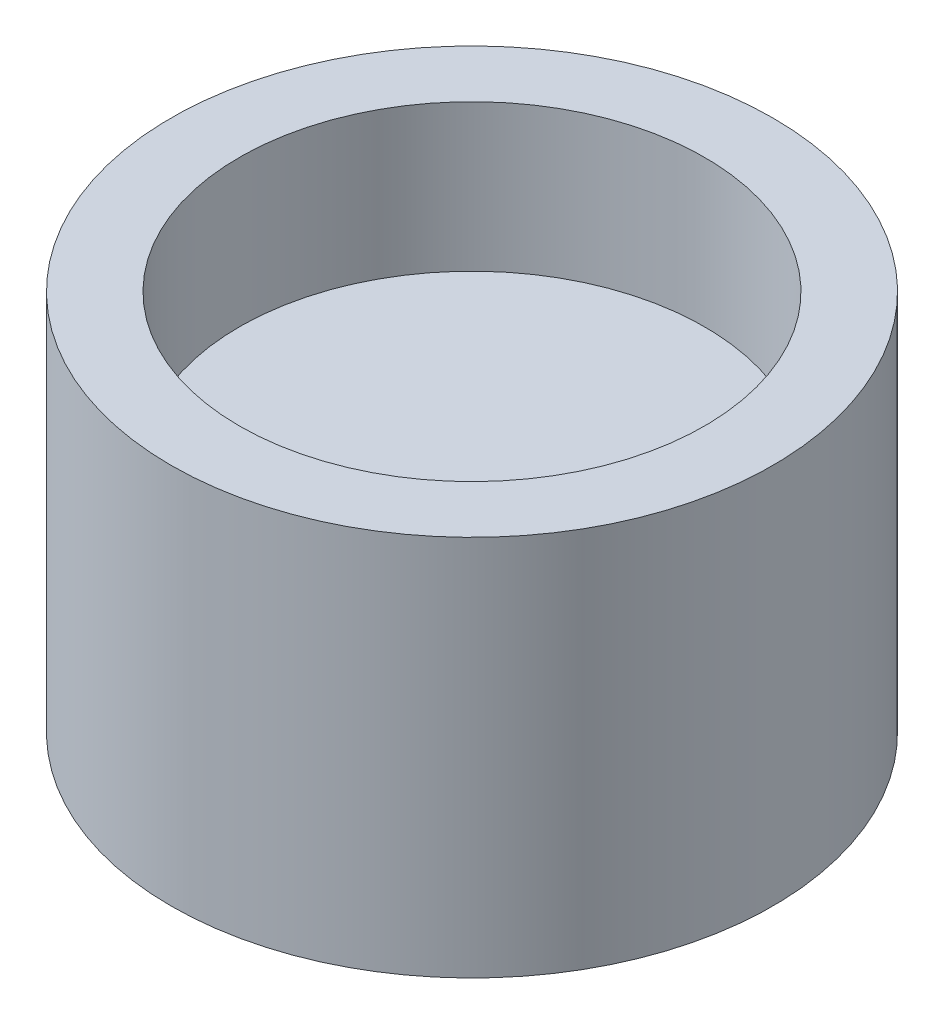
ISO-10303-21;
HEADER;
FILE_DESCRIPTION(('STEP AP214'),'2;1');
FILE_NAME('part.step','',(''),(''),'','','');
FILE_SCHEMA(('AUTOMOTIVE_DESIGN { 1 0 10303 214 1 1 1 1 }'));
ENDSEC;
DATA;
#1=APPLICATION_CONTEXT('core data for automotive mechanical design processes');
#2=APPLICATION_PROTOCOL_DEFINITION('international standard','automotive_design',2000,#1);
#3=PRODUCT_CONTEXT('',#1,'mechanical');
#4=PRODUCT('Part','Part','',(#3));
#5=PRODUCT_RELATED_PRODUCT_CATEGORY('part','',(#4));
#6=PRODUCT_DEFINITION_FORMATION('','',#4);
#7=PRODUCT_DEFINITION_CONTEXT('part definition',#1,'design');
#8=PRODUCT_DEFINITION('design','',#6,#7);
#9=PRODUCT_DEFINITION_SHAPE('','',#8);
#10=(LENGTH_UNIT() NAMED_UNIT(*) SI_UNIT(.MILLI.,.METRE.));
#11=(NAMED_UNIT(*) PLANE_ANGLE_UNIT() SI_UNIT($,.RADIAN.));
#12=(NAMED_UNIT(*) SI_UNIT($,.STERADIAN.) SOLID_ANGLE_UNIT());
#13=UNCERTAINTY_MEASURE_WITH_UNIT(LENGTH_MEASURE(1.E-05),#10,'distance_accuracy_value','');
#14=(GEOMETRIC_REPRESENTATION_CONTEXT(3) GLOBAL_UNCERTAINTY_ASSIGNED_CONTEXT((#13)) GLOBAL_UNIT_ASSIGNED_CONTEXT((#10,
#11,#12)) REPRESENTATION_CONTEXT('',''));
#15=CARTESIAN_POINT('',(0.,0.,0.));
#16=DIRECTION('',(0.,0.,1.));
#17=DIRECTION('',(1.,0.,0.));
#18=AXIS2_PLACEMENT_3D('',#15,#16,#17);
#19=CARTESIAN_POINT('',(0.,6.604,0.));
#20=DIRECTION('',(0.,-1.,0.));
#21=DIRECTION('',(0.,0.,-1.));
#22=AXIS2_PLACEMENT_3D('',#19,#20,#21);
#23=CYLINDRICAL_SURFACE('',#22,5.207);
#24=CARTESIAN_POINT('',(0.,6.604,0.));
#25=DIRECTION('',(0.,1.,0.));
#26=DIRECTION('',(0.,0.,1.));
#27=AXIS2_PLACEMENT_3D('',#24,#25,#26);
#28=CIRCLE('',#27,5.207);
#29=CARTESIAN_POINT('',(0.,6.604,-5.207));
#30=VERTEX_POINT('',#29);
#31=EDGE_CURVE('E10',#30,#30,#28,.T.);
#32=CARTESIAN_POINT('',(0.,0.,0.));
#33=DIRECTION('',(0.,1.,0.));
#34=DIRECTION('',(0.,0.,1.));
#35=AXIS2_PLACEMENT_3D('',#32,#33,#34);
#36=CIRCLE('',#35,5.207);
#37=CARTESIAN_POINT('',(0.,0.,-5.207));
#38=VERTEX_POINT('',#37);
#39=EDGE_CURVE('E33',#38,#38,#36,.T.);
#40=CARTESIAN_POINT('',(0.,6.604,-5.207));
#41=CARTESIAN_POINT('',(0.,6.53520833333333,-5.207));
#42=CARTESIAN_POINT('',(0.,6.46641666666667,-5.207));
#43=CARTESIAN_POINT('',(0.,6.32883333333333,-5.207));
#44=CARTESIAN_POINT('',(0.,6.26004166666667,-5.207));
#45=CARTESIAN_POINT('',(0.,6.12245833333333,-5.207));
#46=CARTESIAN_POINT('',(0.,6.05366666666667,-5.207));
#47=CARTESIAN_POINT('',(0.,5.91608333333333,-5.207));
#48=CARTESIAN_POINT('',(0.,5.84729166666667,-5.207));
#49=CARTESIAN_POINT('',(0.,5.70970833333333,-5.207));
#50=CARTESIAN_POINT('',(0.,5.64091666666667,-5.207));
#51=CARTESIAN_POINT('',(0.,5.50333333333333,-5.207));
#52=CARTESIAN_POINT('',(0.,5.43454166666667,-5.207));
#53=CARTESIAN_POINT('',(0.,5.29695833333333,-5.207));
#54=CARTESIAN_POINT('',(0.,5.22816666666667,-5.207));
#55=CARTESIAN_POINT('',(0.,5.09058333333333,-5.207));
#56=CARTESIAN_POINT('',(0.,5.02179166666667,-5.207));
#57=CARTESIAN_POINT('',(0.,4.88420833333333,-5.207));
#58=CARTESIAN_POINT('',(0.,4.81541666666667,-5.207));
#59=CARTESIAN_POINT('',(0.,4.67783333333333,-5.207));
#60=CARTESIAN_POINT('',(0.,4.60904166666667,-5.207));
#61=CARTESIAN_POINT('',(0.,4.47145833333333,-5.207));
#62=CARTESIAN_POINT('',(0.,4.40266666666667,-5.207));
#63=CARTESIAN_POINT('',(0.,4.26508333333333,-5.207));
#64=CARTESIAN_POINT('',(0.,4.19629166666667,-5.207));
#65=CARTESIAN_POINT('',(0.,4.05870833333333,-5.207));
#66=CARTESIAN_POINT('',(0.,3.98991666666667,-5.207));
#67=CARTESIAN_POINT('',(0.,3.85233333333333,-5.207));
#68=CARTESIAN_POINT('',(0.,3.78354166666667,-5.207));
#69=CARTESIAN_POINT('',(0.,3.64595833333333,-5.207));
#70=CARTESIAN_POINT('',(0.,3.57716666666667,-5.207));
#71=CARTESIAN_POINT('',(0.,3.43958333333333,-5.207));
#72=CARTESIAN_POINT('',(0.,3.37079166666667,-5.207));
#73=CARTESIAN_POINT('',(0.,3.23320833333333,-5.207));
#74=CARTESIAN_POINT('',(0.,3.16441666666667,-5.207));
#75=CARTESIAN_POINT('',(0.,3.02683333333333,-5.207));
#76=CARTESIAN_POINT('',(0.,2.95804166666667,-5.207));
#77=CARTESIAN_POINT('',(0.,2.82045833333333,-5.207));
#78=CARTESIAN_POINT('',(0.,2.75166666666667,-5.207));
#79=CARTESIAN_POINT('',(0.,2.61408333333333,-5.207));
#80=CARTESIAN_POINT('',(0.,2.54529166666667,-5.207));
#81=CARTESIAN_POINT('',(0.,2.40770833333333,-5.207));
#82=CARTESIAN_POINT('',(0.,2.33891666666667,-5.207));
#83=CARTESIAN_POINT('',(0.,2.20133333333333,-5.207));
#84=CARTESIAN_POINT('',(0.,2.13254166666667,-5.207));
#85=CARTESIAN_POINT('',(0.,1.99495833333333,-5.207));
#86=CARTESIAN_POINT('',(0.,1.92616666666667,-5.207));
#87=CARTESIAN_POINT('',(0.,1.78858333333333,-5.207));
#88=CARTESIAN_POINT('',(0.,1.71979166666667,-5.207));
#89=CARTESIAN_POINT('',(0.,1.58220833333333,-5.207));
#90=CARTESIAN_POINT('',(0.,1.51341666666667,-5.207));
#91=CARTESIAN_POINT('',(0.,1.37583333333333,-5.207));
#92=CARTESIAN_POINT('',(0.,1.30704166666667,-5.207));
#93=CARTESIAN_POINT('',(0.,1.16945833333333,-5.207));
#94=CARTESIAN_POINT('',(0.,1.10066666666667,-5.207));
#95=CARTESIAN_POINT('',(0.,0.963083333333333,-5.207));
#96=CARTESIAN_POINT('',(0.,0.894291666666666,-5.207));
#97=CARTESIAN_POINT('',(0.,0.756708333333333,-5.207));
#98=CARTESIAN_POINT('',(0.,0.687916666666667,-5.207));
#99=CARTESIAN_POINT('',(0.,0.550333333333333,-5.207));
#100=CARTESIAN_POINT('',(0.,0.481541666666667,-5.207));
#101=CARTESIAN_POINT('',(0.,0.343958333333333,-5.207));
#102=CARTESIAN_POINT('',(0.,0.275166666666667,-5.207));
#103=CARTESIAN_POINT('',(0.,0.137583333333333,-5.207));
#104=CARTESIAN_POINT('',(0.,0.0687916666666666,-5.207));
#105=CARTESIAN_POINT('',(0.,0.,-5.207));
#106=B_SPLINE_CURVE_WITH_KNOTS('',3,(#40,#41,#42,#43,#44,#45,#46,#47,#48,#49,#50,#51,#52,#53,
#54,#55,#56,#57,#58,#59,#60,#61,#62,#63,#64,#65,#66,#67,#68,#69,#70,#71,#72,#73,#74,#75,#76,#77,
#78,#79,#80,#81,#82,#83,#84,#85,#86,#87,#88,#89,#90,#91,#92,#93,#94,#95,#96,#97,#98,#99,#100,
#101,#102,#103,#104,#105),.UNSPECIFIED.,.F.,.F.,(4,2,2,2,2,2,2,2,2,2,2,2,2,2,2,2,2,2,2,2,2,2,2,
2,2,2,2,2,2,2,2,2,4),(0.,0.206375,0.41275,0.619125,0.8255,1.031875,1.23825,1.444625,1.651,
1.857375,2.06375,2.270125,2.4765,2.682875,2.88925,3.095625,3.302,3.508375,3.71475,3.921125,
4.1275,4.333875,4.54025,4.746625,4.953,5.159375,5.36575,5.572125,5.7785,5.984875,6.19125,
6.397625,6.604),.UNSPECIFIED.);
#107=EDGE_CURVE('BSEAM30',#30,#38,#106,.T.);
#108=ORIENTED_EDGE('',*,*,#31,.F.);
#109=ORIENTED_EDGE('',*,*,#39,.T.);
#110=ORIENTED_EDGE('',*,*,#107,.T.);
#111=ORIENTED_EDGE('',*,*,#107,.F.);
#112=EDGE_LOOP('',(#108,#110,#109,#111));
#113=FACE_BOUND('',#112,.T.);
#114=ADVANCED_FACE('F30',(#113),#23,.T.);
#115=CARTESIAN_POINT('',(0.,6.604,0.));
#116=DIRECTION('',(0.,1.,0.));
#117=DIRECTION('',(0.,0.,1.));
#118=AXIS2_PLACEMENT_3D('',#115,#116,#117);
#119=PLANE('',#118);
#120=CARTESIAN_POINT('',(0.,6.604,0.));
#121=DIRECTION('',(0.,1.,0.));
#122=DIRECTION('',(0.,0.,1.));
#123=AXIS2_PLACEMENT_3D('',#120,#121,#122);
#124=CIRCLE('',#123,4.0259);
#125=CARTESIAN_POINT('',(0.,6.604,4.0259));
#126=VERTEX_POINT('',#125);
#127=EDGE_CURVE('E42',#126,#126,#124,.T.);
#128=ORIENTED_EDGE('',*,*,#127,.F.);
#129=EDGE_LOOP('',(#128));
#130=FACE_BOUND('',#129,.T.);
#131=ORIENTED_EDGE('',*,*,#31,.T.);
#132=EDGE_LOOP('',(#131));
#133=FACE_BOUND('',#132,.T.);
#134=ADVANCED_FACE('F67',(#130,#133),#119,.T.);
#135=CARTESIAN_POINT('',(0.,0.,0.));
#136=DIRECTION('',(0.,1.,0.));
#137=DIRECTION('',(0.,0.,1.));
#138=AXIS2_PLACEMENT_3D('',#135,#136,#137);
#139=PLANE('',#138);
#140=CARTESIAN_POINT('',(0.,0.,0.));
#141=DIRECTION('',(0.,-1.,0.));
#142=DIRECTION('',(0.,0.,-1.));
#143=AXIS2_PLACEMENT_3D('',#140,#141,#142);
#144=CIRCLE('',#143,4.7625);
#145=CARTESIAN_POINT('',(0.,0.,-4.7625));
#146=VERTEX_POINT('',#145);
#147=EDGE_CURVE('E48',#146,#146,#144,.T.);
#148=ORIENTED_EDGE('',*,*,#147,.F.);
#149=EDGE_LOOP('',(#148));
#150=FACE_BOUND('',#149,.T.);
#151=ORIENTED_EDGE('',*,*,#39,.F.);
#152=EDGE_LOOP('',(#151));
#153=FACE_BOUND('',#152,.T.);
#154=ADVANCED_FACE('F63',(#150,#153),#139,.F.);
#155=CARTESIAN_POINT('',(0.,4.064,0.));
#156=DIRECTION('',(0.,1.,0.));
#157=DIRECTION('',(0.,0.,1.));
#158=AXIS2_PLACEMENT_3D('',#155,#156,#157);
#159=CYLINDRICAL_SURFACE('',#158,4.0259);
#160=CARTESIAN_POINT('',(0.,4.064,0.));
#161=DIRECTION('',(0.,1.,0.));
#162=DIRECTION('',(0.,0.,1.));
#163=AXIS2_PLACEMENT_3D('',#160,#161,#162);
#164=CIRCLE('',#163,4.0259);
#165=CARTESIAN_POINT('',(0.,4.064,4.0259));
#166=VERTEX_POINT('',#165);
#167=EDGE_CURVE('E40',#166,#166,#164,.T.);
#168=ORIENTED_EDGE('',*,*,#167,.F.);
#169=EDGE_LOOP('',(#168));
#170=FACE_BOUND('',#169,.T.);
#171=ORIENTED_EDGE('',*,*,#127,.T.);
#172=EDGE_LOOP('',(#171));
#173=FACE_BOUND('',#172,.T.);
#174=ADVANCED_FACE('F66',(#170,#173),#159,.F.);
#175=CARTESIAN_POINT('',(0.,4.064,0.));
#176=DIRECTION('',(0.,1.,0.));
#177=DIRECTION('',(0.,0.,1.));
#178=AXIS2_PLACEMENT_3D('',#175,#176,#177);
#179=PLANE('',#178);
#180=ORIENTED_EDGE('',*,*,#167,.T.);
#181=EDGE_LOOP('',(#180));
#182=FACE_BOUND('',#181,.T.);
#183=ADVANCED_FACE('F59',(#182),#179,.T.);
#184=CARTESIAN_POINT('',(0.,3.175,0.));
#185=DIRECTION('',(0.,-1.,0.));
#186=DIRECTION('',(0.,0.,-1.));
#187=AXIS2_PLACEMENT_3D('',#184,#185,#186);
#188=CYLINDRICAL_SURFACE('',#187,4.7625);
#189=CARTESIAN_POINT('',(0.,3.175,0.));
#190=DIRECTION('',(0.,-1.,0.));
#191=DIRECTION('',(0.,0.,-1.));
#192=AXIS2_PLACEMENT_3D('',#189,#190,#191);
#193=CIRCLE('',#192,4.7625);
#194=CARTESIAN_POINT('',(0.,3.175,-4.7625));
#195=VERTEX_POINT('',#194);
#196=EDGE_CURVE('E45',#195,#195,#193,.T.);
#197=ORIENTED_EDGE('',*,*,#196,.F.);
#198=EDGE_LOOP('',(#197));
#199=FACE_BOUND('',#198,.T.);
#200=ORIENTED_EDGE('',*,*,#147,.T.);
#201=EDGE_LOOP('',(#200));
#202=FACE_BOUND('',#201,.T.);
#203=ADVANCED_FACE('F56',(#199,#202),#188,.F.);
#204=CARTESIAN_POINT('',(0.,3.175,0.));
#205=DIRECTION('',(0.,-1.,0.));
#206=DIRECTION('',(0.,0.,-1.));
#207=AXIS2_PLACEMENT_3D('',#204,#205,#206);
#208=PLANE('',#207);
#209=ORIENTED_EDGE('',*,*,#196,.T.);
#210=EDGE_LOOP('',(#209));
#211=FACE_BOUND('',#210,.T.);
#212=ADVANCED_FACE('F54',(#211),#208,.T.);
#213=CLOSED_SHELL('',(#114,#134,#154,#174,#183,#203,#212));
#214=MANIFOLD_SOLID_BREP('B2',#213);
#215=ADVANCED_BREP_SHAPE_REPRESENTATION('',(#18,#214),#14);
#216=SHAPE_DEFINITION_REPRESENTATION(#9,#215);
ENDSEC;
END-ISO-10303-21;
